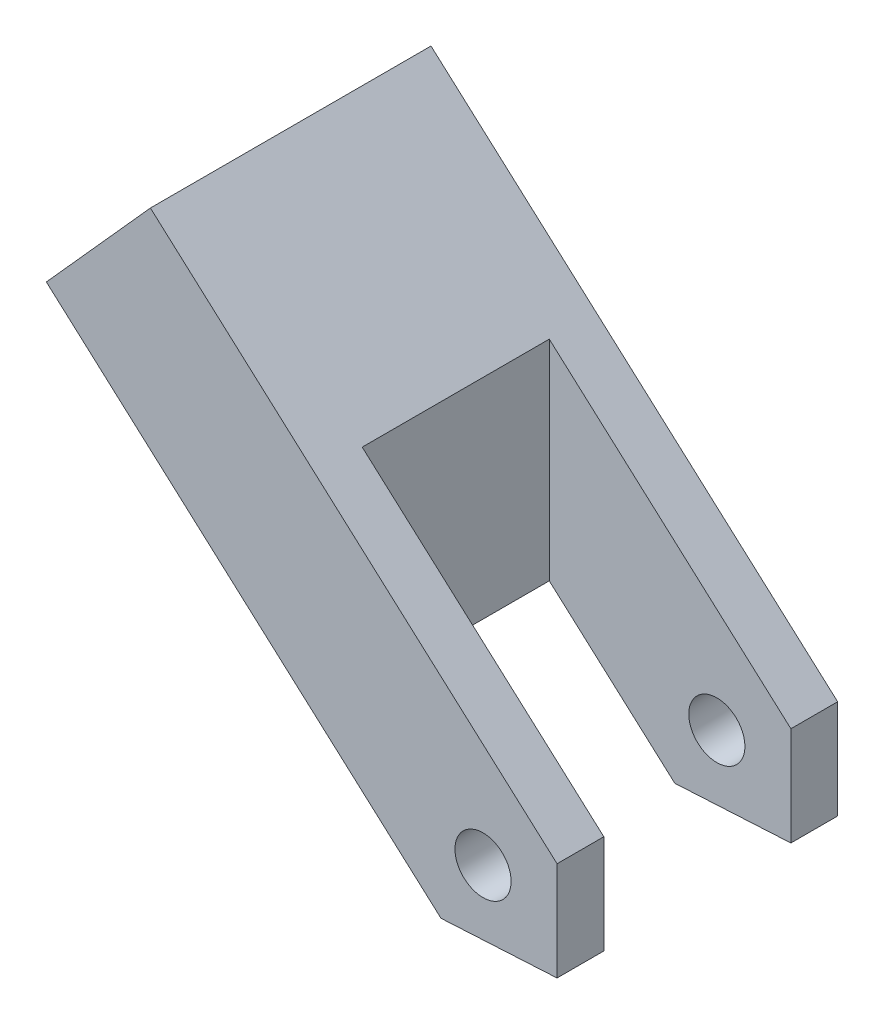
from build123d import *

# Parameters (mm, degrees)
BOSS_EXTRUDE2_DEPTH   = 9
SKETCH3_W             = 7.75
SKETCH3_H             = 6
CUT_EXTRUDE1_DEPTH    = 24.769728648
SKETCH4_R             = 0.9
CUT_EXTRUDE2_DEPTH    = 24.769728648
CHAMFER1_SIZE         = 5
CHAMFER1_SIZE2        = 3.540803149
CHAMFER1_EDGE_2_SIZE  = 5
CHAMFER1_EDGE_2_SIZE2 = 3.540803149


with BuildPart() as part:
    # Sketch2 → Boss-Extrude2 (new body)
    with BuildSketch(Plane.XY):
        Polygon((0, 0), (16.381566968, -14.684831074), (16.381566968, -7.969966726), (3.337461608, 3.723083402), align=None)
    extrude(amount=BOSS_EXTRUDE2_DEPTH)

    # Sketch3 → Cut-Extrude1 (cut, through all)
    with BuildSketch(Plane(origin=(0, 0, 0), x_dir=(1, 0, 0), z_dir=(0, 1, 0))):
        with Locations((12.506566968, -4.5)):
            Rectangle(SKETCH3_W, SKETCH3_H)
    extrude(amount=-CUT_EXTRUDE1_DEPTH, mode=Mode.SUBTRACT)

    # Sketch4 → Cut-Extrude2 (cut, through all)
    with BuildSketch(Plane.XY):
        with Locations(Location((14.006566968, -9.198391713, 0), (0, 0, 180))):
            Circle(SKETCH4_R)
    extrude(amount=CUT_EXTRUDE2_DEPTH, mode=Mode.SUBTRACT)

    # Chamfer1
    chamfer1_edges = [part.edges().sort_by_distance(p)[0] for p in [
        (16.381566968, -14.684831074, 0.75),
    ]]
    chamfer1_side = [part.faces().sort_by_distance(p)[0] for p in [
        (6.202516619, -5.560085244, 4.5),
    ]]
    chamfer(chamfer1_edges, length=CHAMFER1_SIZE, length2=CHAMFER1_SIZE2, reference=chamfer1_side[0])

    # Chamfer1 edge 2
    chamfer1_edge_2_edges = [part.edges().sort_by_distance(p)[0] for p in [
        (16.381566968, -14.684831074, 8.25),
    ]]
    chamfer1_edge_2_side = [part.faces().sort_by_distance(p)[0] for p in [
        (6.202516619, -5.560085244, 4.5),
    ]]
    chamfer(chamfer1_edge_2_edges, length=CHAMFER1_EDGE_2_SIZE, length2=CHAMFER1_EDGE_2_SIZE2, reference=chamfer1_edge_2_side[0])


solid = part.part
